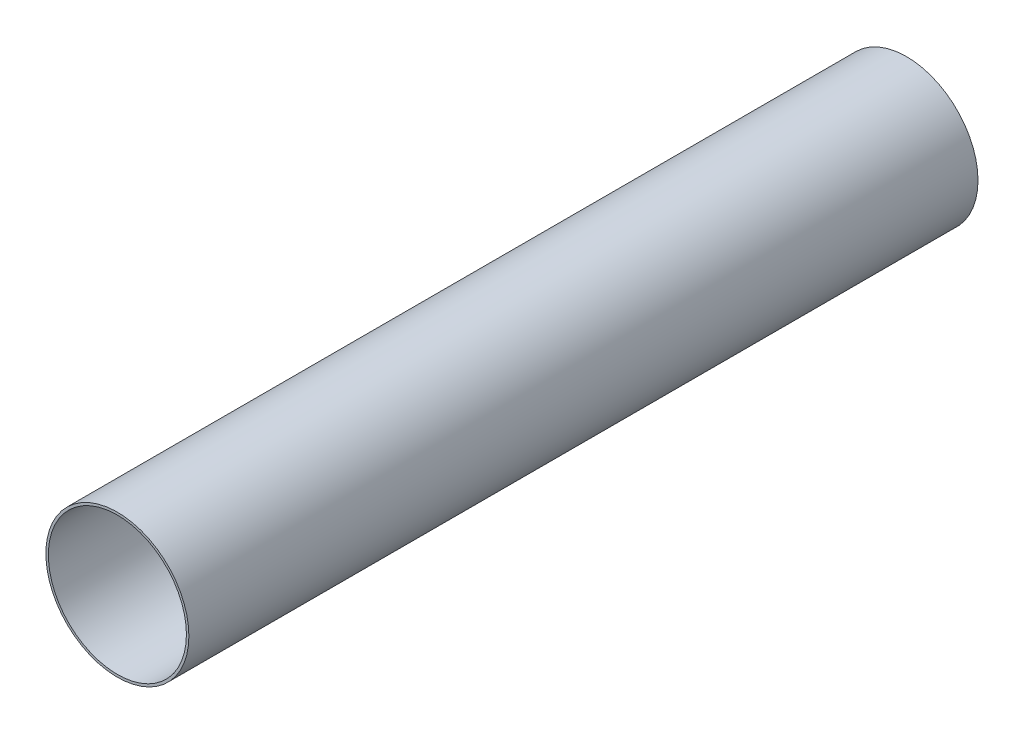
ISO-10303-21;
HEADER;
FILE_DESCRIPTION(('STEP AP214'),'2;1');
FILE_NAME('part.step','',(''),(''),'','','');
FILE_SCHEMA(('AUTOMOTIVE_DESIGN { 1 0 10303 214 1 1 1 1 }'));
ENDSEC;
DATA;
#1=APPLICATION_CONTEXT('core data for automotive mechanical design processes');
#2=APPLICATION_PROTOCOL_DEFINITION('international standard','automotive_design',2000,#1);
#3=PRODUCT_CONTEXT('',#1,'mechanical');
#4=PRODUCT('Part','Part','',(#3));
#5=PRODUCT_RELATED_PRODUCT_CATEGORY('part','',(#4));
#6=PRODUCT_DEFINITION_FORMATION('','',#4);
#7=PRODUCT_DEFINITION_CONTEXT('part definition',#1,'design');
#8=PRODUCT_DEFINITION('design','',#6,#7);
#9=PRODUCT_DEFINITION_SHAPE('','',#8);
#10=(LENGTH_UNIT() NAMED_UNIT(*) SI_UNIT(.MILLI.,.METRE.));
#11=(NAMED_UNIT(*) PLANE_ANGLE_UNIT() SI_UNIT($,.RADIAN.));
#12=(NAMED_UNIT(*) SI_UNIT($,.STERADIAN.) SOLID_ANGLE_UNIT());
#13=UNCERTAINTY_MEASURE_WITH_UNIT(LENGTH_MEASURE(1.E-05),#10,'distance_accuracy_value','');
#14=(GEOMETRIC_REPRESENTATION_CONTEXT(3) GLOBAL_UNCERTAINTY_ASSIGNED_CONTEXT((#13)) GLOBAL_UNIT_ASSIGNED_CONTEXT((#10,
#11,#12)) REPRESENTATION_CONTEXT('',''));
#15=CARTESIAN_POINT('',(0.,0.,0.));
#16=DIRECTION('',(0.,0.,1.));
#17=DIRECTION('',(1.,0.,0.));
#18=AXIS2_PLACEMENT_3D('',#15,#16,#17);
#19=CARTESIAN_POINT('',(0.,0.,254.));
#20=DIRECTION('',(0.,0.,1.));
#21=DIRECTION('',(1.,0.,0.));
#22=AXIS2_PLACEMENT_3D('',#19,#20,#21);
#23=PLANE('',#22);
#24=CARTESIAN_POINT('',(0.,0.,254.));
#25=DIRECTION('',(0.,0.,1.));
#26=DIRECTION('',(1.,0.,0.));
#27=AXIS2_PLACEMENT_3D('',#24,#25,#26);
#28=CIRCLE('',#27,23.01875);
#29=CARTESIAN_POINT('',(23.01875,0.,254.));
#30=VERTEX_POINT('',#29);
#31=EDGE_CURVE('E10',#30,#30,#28,.T.);
#32=ORIENTED_EDGE('',*,*,#31,.T.);
#33=EDGE_LOOP('',(#32));
#34=FACE_BOUND('',#33,.T.);
#35=CARTESIAN_POINT('',(0.,0.,254.));
#36=DIRECTION('',(0.,0.,1.));
#37=DIRECTION('',(1.,0.,0.));
#38=AXIS2_PLACEMENT_3D('',#35,#36,#37);
#39=CIRCLE('',#38,22.225);
#40=CARTESIAN_POINT('',(22.225,0.,254.));
#41=VERTEX_POINT('',#40);
#42=EDGE_CURVE('E40',#41,#41,#39,.T.);
#43=ORIENTED_EDGE('',*,*,#42,.F.);
#44=EDGE_LOOP('',(#43));
#45=FACE_BOUND('',#44,.T.);
#46=ADVANCED_FACE('F29',(#34,#45),#23,.T.);
#47=CARTESIAN_POINT('',(0.,0.,0.));
#48=DIRECTION('',(0.,0.,1.));
#49=DIRECTION('',(1.,0.,0.));
#50=AXIS2_PLACEMENT_3D('',#47,#48,#49);
#51=PLANE('',#50);
#52=CARTESIAN_POINT('',(0.,0.,0.));
#53=DIRECTION('',(0.,0.,1.));
#54=DIRECTION('',(1.,0.,0.));
#55=AXIS2_PLACEMENT_3D('',#52,#53,#54);
#56=CIRCLE('',#55,23.01875);
#57=CARTESIAN_POINT('',(23.01875,0.,0.));
#58=VERTEX_POINT('',#57);
#59=EDGE_CURVE('E36',#58,#58,#56,.T.);
#60=ORIENTED_EDGE('',*,*,#59,.F.);
#61=EDGE_LOOP('',(#60));
#62=FACE_BOUND('',#61,.T.);
#63=CARTESIAN_POINT('',(0.,0.,0.));
#64=DIRECTION('',(0.,0.,1.));
#65=DIRECTION('',(1.,0.,0.));
#66=AXIS2_PLACEMENT_3D('',#63,#64,#65);
#67=CIRCLE('',#66,22.225);
#68=CARTESIAN_POINT('',(22.225,0.,0.));
#69=VERTEX_POINT('',#68);
#70=EDGE_CURVE('E44',#69,#69,#67,.T.);
#71=ORIENTED_EDGE('',*,*,#70,.T.);
#72=EDGE_LOOP('',(#71));
#73=FACE_BOUND('',#72,.T.);
#74=ADVANCED_FACE('F50',(#62,#73),#51,.F.);
#75=CARTESIAN_POINT('',(0.,0.,254.));
#76=DIRECTION('',(0.,0.,-1.));
#77=DIRECTION('',(-1.,0.,0.));
#78=AXIS2_PLACEMENT_3D('',#75,#76,#77);
#79=CYLINDRICAL_SURFACE('',#78,23.01875);
#80=ORIENTED_EDGE('',*,*,#31,.F.);
#81=EDGE_LOOP('',(#80));
#82=FACE_BOUND('',#81,.T.);
#83=ORIENTED_EDGE('',*,*,#59,.T.);
#84=EDGE_LOOP('',(#83));
#85=FACE_BOUND('',#84,.T.);
#86=ADVANCED_FACE('F31',(#82,#85),#79,.T.);
#87=CARTESIAN_POINT('',(0.,0.,254.));
#88=DIRECTION('',(0.,0.,-1.));
#89=DIRECTION('',(-1.,0.,0.));
#90=AXIS2_PLACEMENT_3D('',#87,#88,#89);
#91=CYLINDRICAL_SURFACE('',#90,22.225);
#92=ORIENTED_EDGE('',*,*,#42,.T.);
#93=EDGE_LOOP('',(#92));
#94=FACE_BOUND('',#93,.T.);
#95=ORIENTED_EDGE('',*,*,#70,.F.);
#96=EDGE_LOOP('',(#95));
#97=FACE_BOUND('',#96,.T.);
#98=ADVANCED_FACE('F52',(#94,#97),#91,.F.);
#99=CLOSED_SHELL('',(#46,#74,#86,#98));
#100=MANIFOLD_SOLID_BREP('B2',#99);
#101=ADVANCED_BREP_SHAPE_REPRESENTATION('',(#18,#100),#14);
#102=SHAPE_DEFINITION_REPRESENTATION(#9,#101);
ENDSEC;
END-ISO-10303-21;
